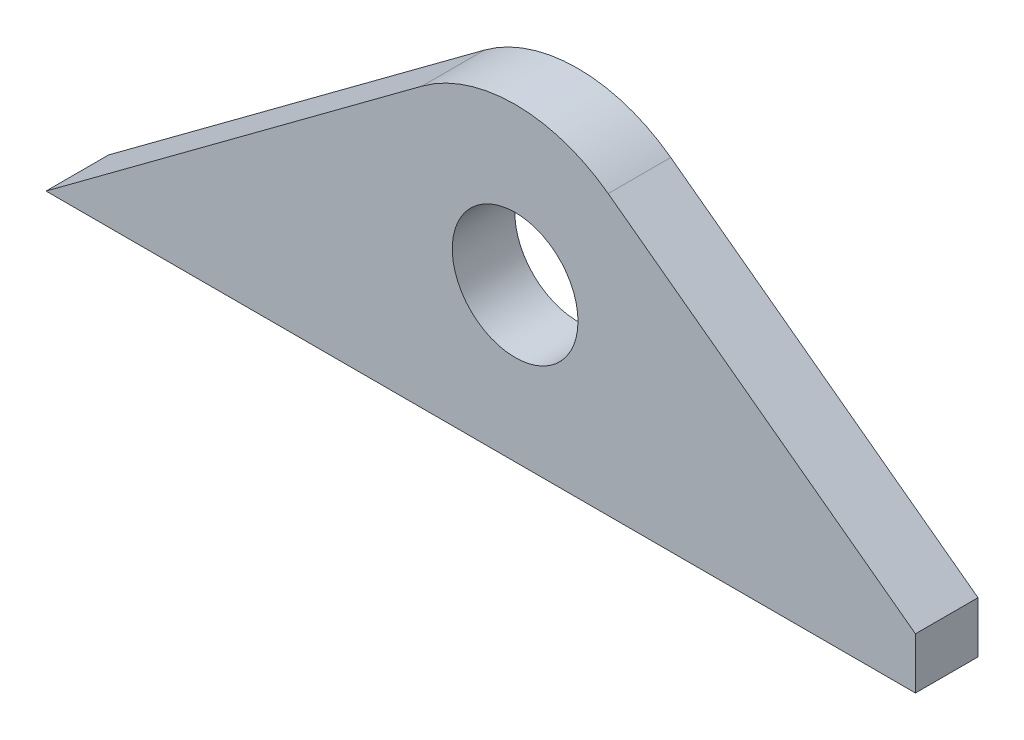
from build123d import *

# Parameters (mm, degrees)
ESQUISSE1_R      = 10.05
EXTRUSION1_DEPTH = 10


with BuildPart() as part:
    # Esquisse1 → Extrusion1 (new body)
    with BuildSketch(Plane.XY):
        with BuildLine():
            Line((64, -24.5), (-75, -24.5))
            Line((-75, -24.5), (-14.892787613, 20.07996208))
            ThreePointArc((-14.892787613, 20.07996208), (-0.006830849, 24.999999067), (14.881812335, 20.088097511))
            Line((14.881812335, 20.088097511), (64, -16.3))
            Line((64, -16.3), (64, -24.5))
        make_face()
        Circle(ESQUISSE1_R, mode=Mode.SUBTRACT)
    extrude(amount=EXTRUSION1_DEPTH)


solid = part.part
